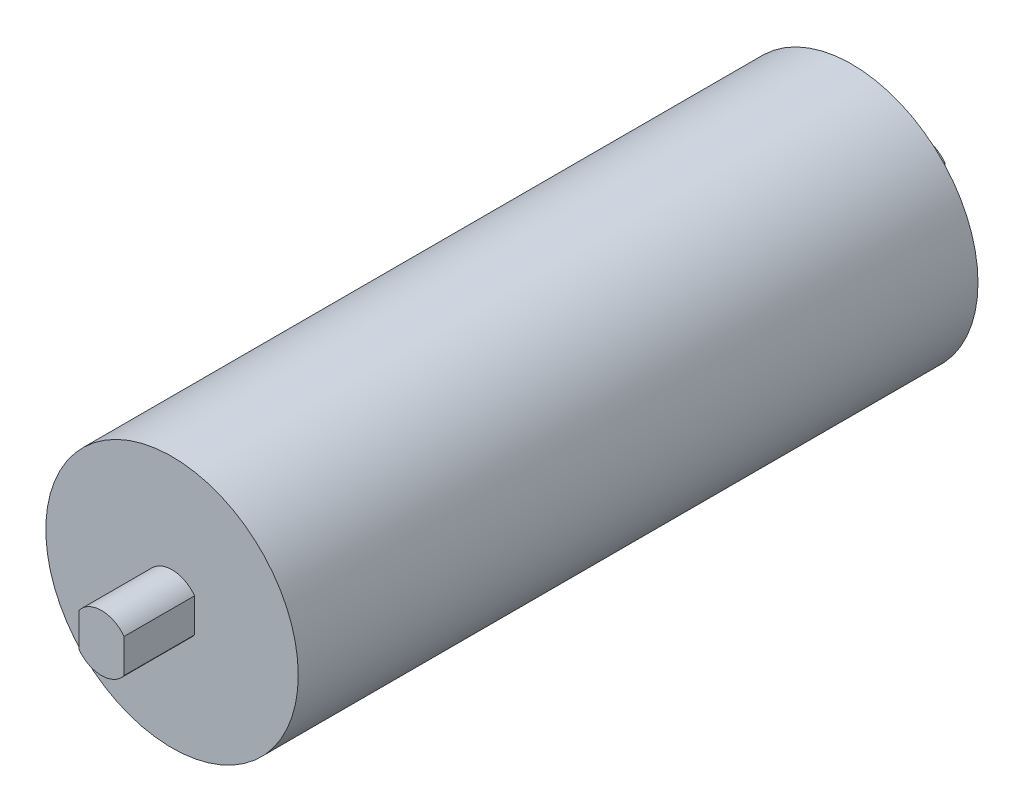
from build123d import *

# Parameters (mm, degrees)
SKETCH_1_R          = 44.75
EXTRUDE_1_DEPTH     = 120.5
SKETCH_2_R          = 10
EXTRUDE_2_DEPTH     = 25
EXTRUDE_START       = 25
SKETCH_3_R          = 10
EXTRUDE_3_DEPTH     = 25
CUT_EXTRUDE_START   = -25
CUT_EXTRUDE_1_DEPTH = 25


with BuildPart() as part:
    # Sketch 1 → Extrude 1 (new, symmetric)
    with BuildSketch(Plane.XY):
        Circle(SKETCH_1_R)
    extrude(amount=EXTRUDE_1_DEPTH, both=True)

    # Sketch 2 → Extrude 2 (add)
    with BuildSketch(Plane.XY.offset(120.5)):
        Circle(SKETCH_2_R)
    extrude(amount=EXTRUDE_2_DEPTH)

    # Sketch 3 → Extrude 3 (add)
    with BuildSketch(Plane(origin=(0, 0, -120.5), x_dir=(-1, 0, 0), z_dir=(0, 0, -1)).offset(EXTRUDE_START)):
        with Locations(Location((0, 0, 0), (0, 0, 180))):
            Circle(SKETCH_3_R)
    extrude(amount=-EXTRUDE_3_DEPTH)

    # Sketch 4 → Cut-Extrude 1 (cut)
    with BuildSketch(Plane.XY.offset(145.5).offset(CUT_EXTRUDE_START)):
        with BuildLine():
            Line((-8, 6), (-8, -6))
            ThreePointArc((-8, -6), (-10, 0), (-8, 6))
        make_face()
        with BuildLine():
            Line((8, 6), (8, -6))
            ThreePointArc((8, -6), (10, 0), (8, 6))
        make_face()
    cut_extrude_1 = extrude(amount=CUT_EXTRUDE_1_DEPTH, mode=Mode.SUBTRACT)

    # Mirror 1: Cut-Extrude 1 across plane
    add(cut_extrude_1.mirror(Plane.XY), mode=Mode.SUBTRACT)


solid = part.part
